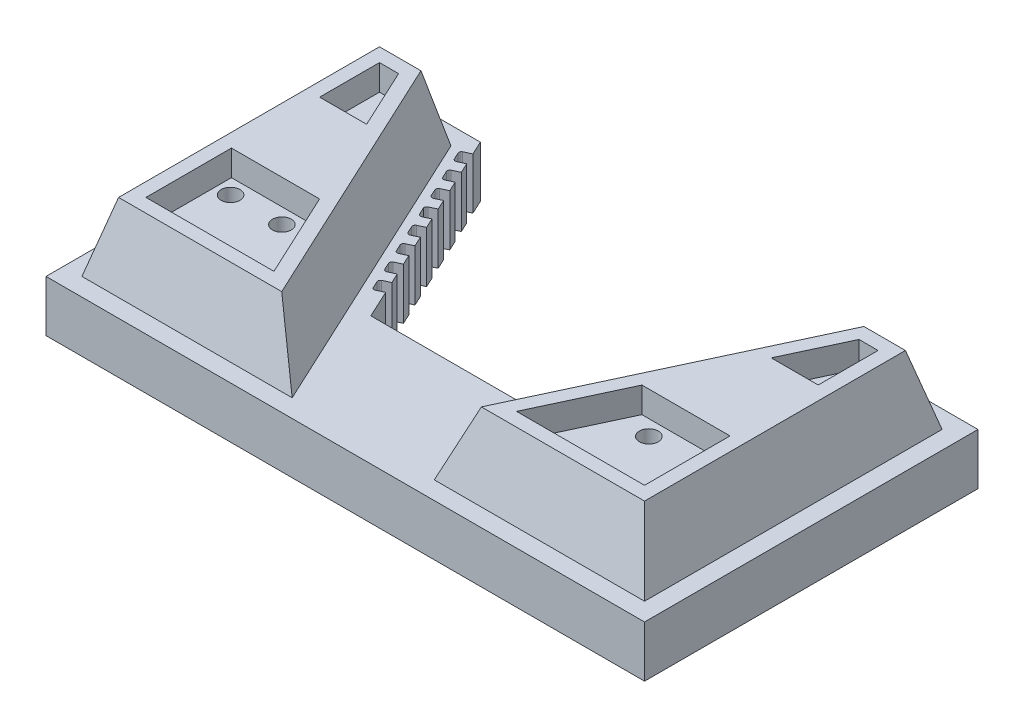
from build123d import *

# Parameters (mm, degrees)
BOSS_EXTRUDE1_DEPTH    = 300
BOSS_EXTRUDE2_DEPTH    = 400
BOSS_EXTRUDE2_TAPER    = 15
CUT_EXTRUDE1_DEPTH     = 150
CUT_EXTRUDE2_DEPTH     = 2651.471656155
FILLET1_R              = 15
LPATTERN1_COUNT        = 8
LPATTERN1_PITCH        = 140
FILLET1_OF_LPATTERN1_R = 15
SKETCH6_R              = 55
CUT_EXTRUDE3_DEPTH     = 150


with BuildPart() as part:
    # Sketch1 → Boss-Extrude1 (new body)
    with BuildSketch(Plane(origin=(0, 0, 0), x_dir=(1, 0, 0), z_dir=(0, 1, 0))):
        Polygon((0, 750), (0, 0), (1750, 0), (1750, 1950), (1160, 1950), (600.430810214, 750), align=None)
    extrude(amount=BOSS_EXTRUDE1_DEPTH)

    # Sketch3 → Boss-Extrude2 (add)
    with BuildSketch(Plane(origin=(0, 300, 0), x_dir=(1, 0, 0), z_dir=(0, 1, 0))):
        Polygon((1645, 105), (1645, 1845), (1226.892377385, 1845), (415.517052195, 105), align=None)
    extrude(amount=BOSS_EXTRUDE2_DEPTH, taper=BOSS_EXTRUDE2_TAPER)

    # Sketch4 → Cut-Extrude1 (cut)
    with BuildSketch(Plane(origin=(0, 700, 0), x_dir=(1, 0, 0), z_dir=(0, 1, 0))):
        Polygon((942.484120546, 792.179676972), (1457.820323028, 792.179676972), (1457.820323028, 292.179676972), (709.330291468, 292.179676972), align=None)
        Polygon((1182.931302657, 1307.820323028), (1457.820323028, 1307.820323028), (1457.820323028, 1657.820323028), (1346.138983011, 1657.820323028), align=None)
    extrude(amount=-CUT_EXTRUDE1_DEPTH, mode=Mode.SUBTRACT)

    # Sketch5 → Cut-Extrude2 (cut, through all)
    with BuildSketch(Plane(origin=(0, 300, 0), x_dir=(1, 0, 0), z_dir=(0, 1, 0))):
        Polygon((1121.964356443, 1868.432299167), (1176.342823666, 1843.075203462), (1144.646454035, 1775.102119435), (1090.267986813, 1800.459215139), align=None)
    cut_extrude2 = extrude(amount=-CUT_EXTRUDE2_DEPTH, mode=Mode.SUBTRACT)

    # Fillet1
    fillet1_edges = [part.edges().sort_by_distance(p)[0] for p in [
        (1176.342823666, 150, -1843.075203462),
        (1144.646454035, 150, -1775.102119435),
    ]]
    fillet(fillet1_edges, radius=FILLET1_R)

    # LPattern1: Cut-Extrude2 ×8
    with Locations(*[Vector(-0.4226182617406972, 0, 0.9063077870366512) * (i * LPATTERN1_PITCH) for i in range(1, LPATTERN1_COUNT)]):
        add(cut_extrude2, mode=Mode.SUBTRACT)

    # Fillet1 of LPattern1
    fillet1_of_lpattern1_edges = [part.edges().sort_by_distance(p)[0] for p in [
        (1117.176267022, 150, -1716.192113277),
        (1085.479897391, 150, -1648.219029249),
        (1058.009710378, 150, -1589.309023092),
        (1026.313340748, 150, -1521.335939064),
        (998.843153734, 150, -1462.425932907),
        (967.146784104, 150, -1394.452848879),
        (939.676597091, 150, -1335.542842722),
        (907.98022746, 150, -1267.569758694),
        (880.510040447, 150, -1208.659752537),
        (848.813670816, 150, -1140.686668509),
        (821.343483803, 150, -1081.776662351),
        (789.647114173, 150, -1013.803578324),
        (762.17692716, 150, -954.893572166),
        (730.480557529, 150, -886.920488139),
    ]]
    fillet(fillet1_of_lpattern1_edges, radius=FILLET1_OF_LPATTERN1_R)

    # Sketch6 → Cut-Extrude3 (cut)
    with BuildSketch(Plane(origin=(0, 550, 0), x_dir=(1, 0, 0), z_dir=(0, 1, 0))):
        with Locations(Location((1372.820323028, 702.179676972, 0), (0, 0, 270))):
            Circle(SKETCH6_R)
        with Locations(Location((1372.820323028, 382.179676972, 0), (0, 0, 270))):
            Circle(SKETCH6_R)
        with Locations(Location((1072.820323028, 702.179676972, 0), (0, 0, 270))):
            Circle(SKETCH6_R)
        with Locations(Location((922.820323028, 382.179676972, 0), (0, 0, 270))):
            Circle(SKETCH6_R)
    extrude(amount=-CUT_EXTRUDE3_DEPTH, mode=Mode.SUBTRACT)

    # Mirror1: part across plane


with BuildPart() as part_1:
    add(part.part)
    add(part.part.mirror(Plane(origin=(0, 0, 0), x_dir=(0, 0, 1), z_dir=(1, 0, 0))))


solid = part_1.part
